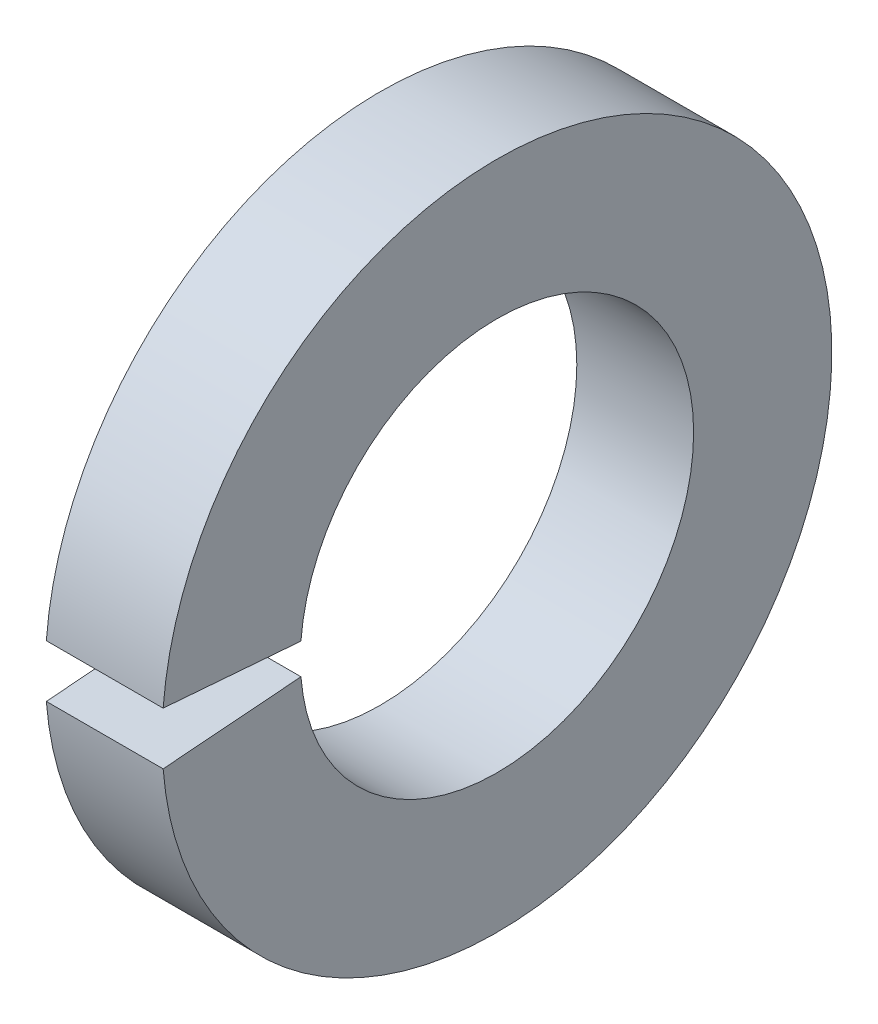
ISO-10303-21;
HEADER;
FILE_DESCRIPTION(('STEP AP214'),'2;1');
FILE_NAME('part.step','',(''),(''),'','','');
FILE_SCHEMA(('AUTOMOTIVE_DESIGN { 1 0 10303 214 1 1 1 1 }'));
ENDSEC;
DATA;
#1=APPLICATION_CONTEXT('core data for automotive mechanical design processes');
#2=APPLICATION_PROTOCOL_DEFINITION('international standard','automotive_design',2000,#1);
#3=PRODUCT_CONTEXT('',#1,'mechanical');
#4=PRODUCT('Part','Part','',(#3));
#5=PRODUCT_RELATED_PRODUCT_CATEGORY('part','',(#4));
#6=PRODUCT_DEFINITION_FORMATION('','',#4);
#7=PRODUCT_DEFINITION_CONTEXT('part definition',#1,'design');
#8=PRODUCT_DEFINITION('design','',#6,#7);
#9=PRODUCT_DEFINITION_SHAPE('','',#8);
#10=(LENGTH_UNIT() NAMED_UNIT(*) SI_UNIT(.MILLI.,.METRE.));
#11=(NAMED_UNIT(*) PLANE_ANGLE_UNIT() SI_UNIT($,.RADIAN.));
#12=(NAMED_UNIT(*) SI_UNIT($,.STERADIAN.) SOLID_ANGLE_UNIT());
#13=UNCERTAINTY_MEASURE_WITH_UNIT(LENGTH_MEASURE(1.E-05),#10,'distance_accuracy_value','');
#14=(GEOMETRIC_REPRESENTATION_CONTEXT(3) GLOBAL_UNCERTAINTY_ASSIGNED_CONTEXT((#13)) GLOBAL_UNIT_ASSIGNED_CONTEXT((#10,
#11,#12)) REPRESENTATION_CONTEXT('',''));
#15=CARTESIAN_POINT('',(0.,0.,0.));
#16=DIRECTION('',(0.,0.,1.));
#17=DIRECTION('',(1.,0.,0.));
#18=AXIS2_PLACEMENT_3D('',#15,#16,#17);
#19=CARTESIAN_POINT('',(-34.9249999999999,0.,0.));
#20=DIRECTION('',(-1.,0.,0.));
#21=DIRECTION('',(0.,0.,1.));
#22=AXIS2_PLACEMENT_3D('',#19,#20,#21);
#23=CYLINDRICAL_SURFACE('',#22,10.1);
#24=CARTESIAN_POINT('',(0.,0.,0.));
#25=DIRECTION('',(-1.,0.,0.));
#26=DIRECTION('',(0.,0.,1.));
#27=AXIS2_PLACEMENT_3D('',#24,#25,#26);
#28=CIRCLE('',#27,10.1);
#29=CARTESIAN_POINT('',(0.,0.792436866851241,10.0688650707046));
#30=VERTEX_POINT('',#29);
#31=CARTESIAN_POINT('',(0.,-0.792436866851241,10.0688650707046));
#32=VERTEX_POINT('',#31);
#33=EDGE_CURVE('E83',#30,#32,#28,.T.);
#34=ORIENTED_EDGE('',*,*,#33,.F.);
#35=DIRECTION('',(-1.,0.,0.));
#36=VECTOR('',#35,1.);
#37=CARTESIAN_POINT('',(-34.9249999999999,0.79243686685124,10.0688650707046));
#38=LINE('',#37,#36);
#39=CARTESIAN_POINT('',(-6.,0.792436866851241,10.0688650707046));
#40=VERTEX_POINT('',#39);
#41=EDGE_CURVE('E97',#30,#40,#38,.T.);
#42=ORIENTED_EDGE('',*,*,#41,.T.);
#43=CARTESIAN_POINT('',(-6.,0.,0.));
#44=DIRECTION('',(-1.,0.,0.));
#45=DIRECTION('',(0.,0.,1.));
#46=AXIS2_PLACEMENT_3D('',#43,#44,#45);
#47=CIRCLE('',#46,10.1);
#48=CARTESIAN_POINT('',(-6.,-0.792436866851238,10.0688650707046));
#49=VERTEX_POINT('',#48);
#50=EDGE_CURVE('E85',#40,#49,#47,.T.);
#51=ORIENTED_EDGE('',*,*,#50,.T.);
#52=DIRECTION('',(-1.,0.,0.));
#53=VECTOR('',#52,1.);
#54=CARTESIAN_POINT('',(-34.9249999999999,-0.79243686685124,10.0688650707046));
#55=LINE('',#54,#53);
#56=EDGE_CURVE('E53',#32,#49,#55,.T.);
#57=ORIENTED_EDGE('',*,*,#56,.F.);
#58=EDGE_LOOP('',(#34,#42,#51,#57));
#59=FACE_BOUND('',#58,.T.);
#60=ADVANCED_FACE('F32',(#59),#23,.F.);
#61=CARTESIAN_POINT('',(0.,10.1,0.));
#62=DIRECTION('',(-1.,0.,0.));
#63=DIRECTION('',(0.,0.,1.));
#64=AXIS2_PLACEMENT_3D('',#61,#62,#63);
#65=PLANE('',#64);
#66=CARTESIAN_POINT('',(0.,0.,0.));
#67=DIRECTION('',(-1.,0.,0.));
#68=DIRECTION('',(0.,0.,1.));
#69=AXIS2_PLACEMENT_3D('',#66,#67,#68);
#70=CIRCLE('',#69,17.2);
#71=CARTESIAN_POINT('',(0.,1.34949644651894,17.1469781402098));
#72=VERTEX_POINT('',#71);
#73=CARTESIAN_POINT('',(0.,-1.34949644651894,17.1469781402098));
#74=VERTEX_POINT('',#73);
#75=EDGE_CURVE('E89',#72,#74,#70,.T.);
#76=ORIENTED_EDGE('',*,*,#75,.F.);
#77=DIRECTION('',(0.,0.0784590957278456,0.996917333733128));
#78=VECTOR('',#77,1.);
#79=CARTESIAN_POINT('',(0.,0.,0.));
#80=LINE('',#79,#78);
#81=EDGE_CURVE('E77',#30,#72,#80,.T.);
#82=ORIENTED_EDGE('',*,*,#81,.F.);
#83=ORIENTED_EDGE('',*,*,#33,.T.);
#84=DIRECTION('',(0.,-0.0784590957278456,0.996917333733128));
#85=VECTOR('',#84,1.);
#86=CARTESIAN_POINT('',(0.,0.,0.));
#87=LINE('',#86,#85);
#88=EDGE_CURVE('E69',#32,#74,#87,.T.);
#89=ORIENTED_EDGE('',*,*,#88,.T.);
#90=EDGE_LOOP('',(#76,#82,#83,#89));
#91=FACE_BOUND('',#90,.T.);
#92=ADVANCED_FACE('F88',(#91),#65,.F.);
#93=CARTESIAN_POINT('',(-34.9249999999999,0.,0.));
#94=DIRECTION('',(-1.,0.,0.));
#95=DIRECTION('',(0.,0.,1.));
#96=AXIS2_PLACEMENT_3D('',#93,#94,#95);
#97=CYLINDRICAL_SURFACE('',#96,17.2);
#98=CARTESIAN_POINT('',(-6.,0.,0.));
#99=DIRECTION('',(-1.,0.,0.));
#100=DIRECTION('',(0.,0.,1.));
#101=AXIS2_PLACEMENT_3D('',#98,#99,#100);
#102=CIRCLE('',#101,17.2);
#103=CARTESIAN_POINT('',(-6.,1.34949644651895,17.1469781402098));
#104=VERTEX_POINT('',#103);
#105=CARTESIAN_POINT('',(-6.,-1.34949644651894,17.1469781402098));
#106=VERTEX_POINT('',#105);
#107=EDGE_CURVE('E91',#104,#106,#102,.T.);
#108=ORIENTED_EDGE('',*,*,#107,.F.);
#109=DIRECTION('',(-1.,0.,0.));
#110=VECTOR('',#109,1.);
#111=CARTESIAN_POINT('',(-34.9249999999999,1.34949644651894,17.1469781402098));
#112=LINE('',#111,#110);
#113=EDGE_CURVE('E46',#104,#72,#112,.F.);
#114=ORIENTED_EDGE('',*,*,#113,.T.);
#115=ORIENTED_EDGE('',*,*,#75,.T.);
#116=DIRECTION('',(-1.,0.,0.));
#117=VECTOR('',#116,1.);
#118=CARTESIAN_POINT('',(-34.9249999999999,-1.34949644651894,17.1469781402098));
#119=LINE('',#118,#117);
#120=EDGE_CURVE('E72',#106,#74,#119,.F.);
#121=ORIENTED_EDGE('',*,*,#120,.F.);
#122=EDGE_LOOP('',(#108,#114,#115,#121));
#123=FACE_BOUND('',#122,.T.);
#124=ADVANCED_FACE('F104',(#123),#97,.T.);
#125=CARTESIAN_POINT('',(-6.,17.2,0.));
#126=DIRECTION('',(1.,0.,0.));
#127=DIRECTION('',(0.,0.,-1.));
#128=AXIS2_PLACEMENT_3D('',#125,#126,#127);
#129=PLANE('',#128);
#130=ORIENTED_EDGE('',*,*,#50,.F.);
#131=DIRECTION('',(0.,0.0784590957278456,0.996917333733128));
#132=VECTOR('',#131,1.);
#133=CARTESIAN_POINT('',(-6.,0.10588027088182,1.345336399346));
#134=LINE('',#133,#132);
#135=EDGE_CURVE('E11',#40,#104,#134,.T.);
#136=ORIENTED_EDGE('',*,*,#135,.T.);
#137=ORIENTED_EDGE('',*,*,#107,.T.);
#138=DIRECTION('',(0.,-0.0784590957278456,0.996917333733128));
#139=VECTOR('',#138,1.);
#140=CARTESIAN_POINT('',(-6.,0.10588027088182,-1.345336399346));
#141=LINE('',#140,#139);
#142=EDGE_CURVE('E39',#49,#106,#141,.T.);
#143=ORIENTED_EDGE('',*,*,#142,.F.);
#144=EDGE_LOOP('',(#130,#136,#137,#143));
#145=FACE_BOUND('',#144,.T.);
#146=ADVANCED_FACE('F106',(#145),#129,.F.);
#147=CARTESIAN_POINT('',(-6.,0.,0.));
#148=DIRECTION('',(0.,0.996917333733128,0.0784590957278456));
#149=DIRECTION('',(0.,-0.0784590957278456,0.996917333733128));
#150=AXIS2_PLACEMENT_3D('',#147,#148,#149);
#151=PLANE('',#150);
#152=ORIENTED_EDGE('',*,*,#56,.T.);
#153=ORIENTED_EDGE('',*,*,#142,.T.);
#154=ORIENTED_EDGE('',*,*,#120,.T.);
#155=ORIENTED_EDGE('',*,*,#88,.F.);
#156=EDGE_LOOP('',(#152,#153,#154,#155));
#157=FACE_BOUND('',#156,.T.);
#158=ADVANCED_FACE('F70',(#157),#151,.T.);
#159=CARTESIAN_POINT('',(-6.,0.,0.));
#160=DIRECTION('',(0.,0.996917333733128,-0.0784590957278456));
#161=DIRECTION('',(0.,0.0784590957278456,0.996917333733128));
#162=AXIS2_PLACEMENT_3D('',#159,#160,#161);
#163=PLANE('',#162);
#164=ORIENTED_EDGE('',*,*,#81,.T.);
#165=ORIENTED_EDGE('',*,*,#113,.F.);
#166=ORIENTED_EDGE('',*,*,#135,.F.);
#167=ORIENTED_EDGE('',*,*,#41,.F.);
#168=EDGE_LOOP('',(#164,#165,#166,#167));
#169=FACE_BOUND('',#168,.T.);
#170=ADVANCED_FACE('F101',(#169),#163,.F.);
#171=CLOSED_SHELL('',(#60,#92,#124,#146,#158,#170));
#172=MANIFOLD_SOLID_BREP('B2',#171);
#173=ADVANCED_BREP_SHAPE_REPRESENTATION('',(#18,#172),#14);
#174=SHAPE_DEFINITION_REPRESENTATION(#9,#173);
ENDSEC;
END-ISO-10303-21;
